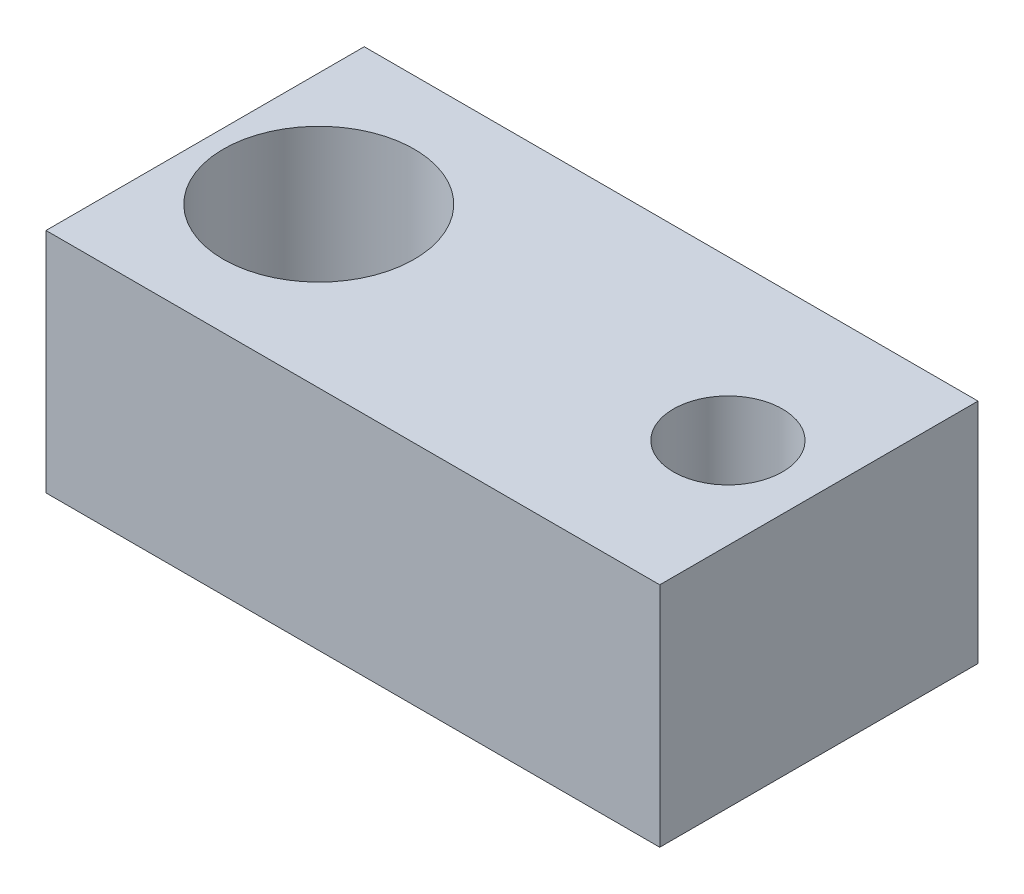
from build123d import *

# Parameters (mm, degrees)
ESQUISSE1_W             = 135
ESQUISSE1_H             = 50
BASE_EXTRUSION_DEPTH    = 70
ESQUISSE2_R             = 21
ENL_V_MAT_EXTRU_1_DEPTH = 161.078105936
ESQUISSE3_R             = 12
ENL_V_MAT_EXTRU_2_DEPTH = 161.078105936


with BuildPart() as part:
    # Esquisse1 → Base-Extrusion (new body)
    with BuildSketch(Plane.XY):
        with Locations((67.5, 25)):
            Rectangle(ESQUISSE1_W, ESQUISSE1_H)
    extrude(amount=BASE_EXTRUSION_DEPTH)

    # Esquisse2 → Enl_v. mat.-Extru.1 (cut, through all)
    with BuildSketch(Plane(origin=(0, 50, 0), x_dir=(-1, 0, 0), z_dir=(0, 1, 0))):
        with Locations(Location((-25, 35, 0), (0, 0, 90))):
            Circle(ESQUISSE2_R)
    extrude(amount=-ENL_V_MAT_EXTRU_1_DEPTH, mode=Mode.SUBTRACT)

    # Esquisse3 → Enl_v. mat.-Extru.2 (cut, through all)
    with BuildSketch(Plane(origin=(0, 50, 0), x_dir=(-1, 0, 0), z_dir=(0, 1, 0))):
        with Locations(Location((-115, 35, 0), (0, 0, 90))):
            Circle(ESQUISSE3_R)
    extrude(amount=-ENL_V_MAT_EXTRU_2_DEPTH, mode=Mode.SUBTRACT)


solid = part.part
